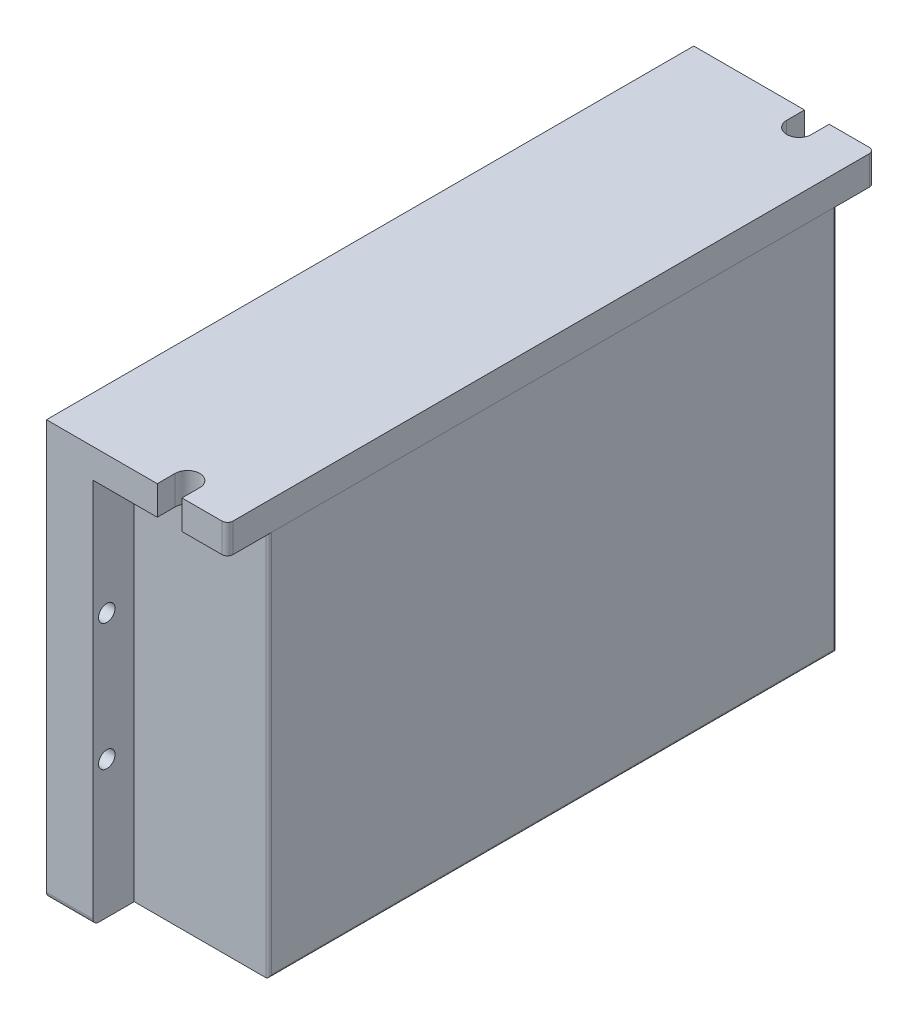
ISO-10303-21;
HEADER;
FILE_DESCRIPTION(('STEP AP214'),'2;1');
FILE_NAME('part.step','',(''),(''),'','','');
FILE_SCHEMA(('AUTOMOTIVE_DESIGN { 1 0 10303 214 1 1 1 1 }'));
ENDSEC;
DATA;
#1=APPLICATION_CONTEXT('core data for automotive mechanical design processes');
#2=APPLICATION_PROTOCOL_DEFINITION('international standard','automotive_design',2000,#1);
#3=PRODUCT_CONTEXT('',#1,'mechanical');
#4=PRODUCT('Part','Part','',(#3));
#5=PRODUCT_RELATED_PRODUCT_CATEGORY('part','',(#4));
#6=PRODUCT_DEFINITION_FORMATION('','',#4);
#7=PRODUCT_DEFINITION_CONTEXT('part definition',#1,'design');
#8=PRODUCT_DEFINITION('design','',#6,#7);
#9=PRODUCT_DEFINITION_SHAPE('','',#8);
#10=(LENGTH_UNIT() NAMED_UNIT(*) SI_UNIT(.MILLI.,.METRE.));
#11=(NAMED_UNIT(*) PLANE_ANGLE_UNIT() SI_UNIT($,.RADIAN.));
#12=(NAMED_UNIT(*) SI_UNIT($,.STERADIAN.) SOLID_ANGLE_UNIT());
#13=UNCERTAINTY_MEASURE_WITH_UNIT(LENGTH_MEASURE(1.E-05),#10,'distance_accuracy_value','');
#14=(GEOMETRIC_REPRESENTATION_CONTEXT(3) GLOBAL_UNCERTAINTY_ASSIGNED_CONTEXT((#13)) GLOBAL_UNIT_ASSIGNED_CONTEXT((#10,
#11,#12)) REPRESENTATION_CONTEXT('',''));
#15=CARTESIAN_POINT('',(0.,0.,0.));
#16=DIRECTION('',(0.,0.,1.));
#17=DIRECTION('',(1.,0.,0.));
#18=AXIS2_PLACEMENT_3D('',#15,#16,#17);
#19=CARTESIAN_POINT('',(33.,32.5,51.5));
#20=DIRECTION('',(0.,-1.,0.));
#21=DIRECTION('',(0.,0.,-1.));
#22=AXIS2_PLACEMENT_3D('',#19,#20,#21);
#23=PLANE('',#22);
#24=DIRECTION('',(0.,0.,1.));
#25=VECTOR('',#24,1.);
#26=CARTESIAN_POINT('',(33.,32.5,51.5));
#27=LINE('',#26,#25);
#28=CARTESIAN_POINT('',(33.,32.5,-51.5));
#29=VERTEX_POINT('',#28);
#30=CARTESIAN_POINT('',(33.,32.5,51.));
#31=VERTEX_POINT('',#30);
#32=EDGE_CURVE('E125',#29,#31,#27,.T.);
#33=ORIENTED_EDGE('',*,*,#32,.F.);
#34=CARTESIAN_POINT('',(32.5,32.5,-51.5));
#35=DIRECTION('',(0.,-1.,0.));
#36=DIRECTION('',(0.,0.,-1.));
#37=AXIS2_PLACEMENT_3D('',#34,#35,#36);
#38=CIRCLE('',#37,0.5);
#39=CARTESIAN_POINT('',(32.5,32.5,-52.));
#40=VERTEX_POINT('',#39);
#41=EDGE_CURVE('E142',#29,#40,#38,.F.);
#42=ORIENTED_EDGE('',*,*,#41,.T.);
#43=DIRECTION('',(-1.,0.,0.));
#44=VECTOR('',#43,1.);
#45=CARTESIAN_POINT('',(33.,32.5,-52.));
#46=LINE('',#45,#44);
#47=CARTESIAN_POINT('',(8.5,32.5,-52.));
#48=VERTEX_POINT('',#47);
#49=EDGE_CURVE('E119',#40,#48,#46,.T.);
#50=ORIENTED_EDGE('',*,*,#49,.T.);
#51=DIRECTION('',(0.,0.,1.));
#52=VECTOR('',#51,1.);
#53=CARTESIAN_POINT('',(8.5,32.5,51.5));
#54=LINE('',#53,#52);
#55=CARTESIAN_POINT('',(8.5,32.5,51.5));
#56=VERTEX_POINT('',#55);
#57=EDGE_CURVE('E114',#48,#56,#54,.T.);
#58=ORIENTED_EDGE('',*,*,#57,.T.);
#59=DIRECTION('',(-1.,0.,0.));
#60=VECTOR('',#59,1.);
#61=CARTESIAN_POINT('',(33.,32.5,51.5));
#62=LINE('',#61,#60);
#63=CARTESIAN_POINT('',(32.5,32.5,51.5));
#64=VERTEX_POINT('',#63);
#65=EDGE_CURVE('E98',#64,#56,#62,.T.);
#66=ORIENTED_EDGE('',*,*,#65,.F.);
#67=CARTESIAN_POINT('',(32.5,32.5,51.));
#68=DIRECTION('',(0.,-1.,0.));
#69=DIRECTION('',(0.,0.,-1.));
#70=AXIS2_PLACEMENT_3D('',#67,#68,#69);
#71=CIRCLE('',#70,0.5);
#72=EDGE_CURVE('E140',#64,#31,#71,.F.);
#73=ORIENTED_EDGE('',*,*,#72,.T.);
#74=EDGE_LOOP('',(#33,#42,#50,#58,#66,#73));
#75=FACE_BOUND('',#74,.T.);
#76=ADVANCED_FACE('F44',(#75),#23,.F.);
#77=CARTESIAN_POINT('',(33.,32.5,51.5));
#78=DIRECTION('',(0.,0.,-1.));
#79=DIRECTION('',(-1.,0.,0.));
#80=AXIS2_PLACEMENT_3D('',#77,#78,#79);
#81=PLANE('',#80);
#82=DIRECTION('',(-1.,0.,0.));
#83=VECTOR('',#82,1.);
#84=CARTESIAN_POINT('',(33.,-37.8,51.5));
#85=LINE('',#84,#83);
#86=CARTESIAN_POINT('',(32.5,-37.8,51.5));
#87=VERTEX_POINT('',#86);
#88=CARTESIAN_POINT('',(8.5,-37.8,51.5));
#89=VERTEX_POINT('',#88);
#90=EDGE_CURVE('E108',#87,#89,#85,.T.);
#91=ORIENTED_EDGE('',*,*,#90,.F.);
#92=DIRECTION('',(0.,-1.,0.));
#93=VECTOR('',#92,1.);
#94=CARTESIAN_POINT('',(32.5,32.5,51.5));
#95=LINE('',#94,#93);
#96=EDGE_CURVE('E53',#87,#64,#95,.F.);
#97=ORIENTED_EDGE('',*,*,#96,.T.);
#98=ORIENTED_EDGE('',*,*,#65,.T.);
#99=DIRECTION('',(0.,-1.,0.));
#100=VECTOR('',#99,1.);
#101=CARTESIAN_POINT('',(8.5,32.5,51.5));
#102=LINE('',#101,#100);
#103=EDGE_CURVE('E101',#56,#89,#102,.T.);
#104=ORIENTED_EDGE('',*,*,#103,.T.);
#105=EDGE_LOOP('',(#91,#97,#98,#104));
#106=FACE_BOUND('',#105,.T.);
#107=ADVANCED_FACE('F100',(#106),#81,.F.);
#108=CARTESIAN_POINT('',(33.,-37.8,51.5));
#109=DIRECTION('',(0.,1.,0.));
#110=DIRECTION('',(0.,0.,1.));
#111=AXIS2_PLACEMENT_3D('',#108,#109,#110);
#112=PLANE('',#111);
#113=DIRECTION('',(-1.,0.,0.));
#114=VECTOR('',#113,1.);
#115=CARTESIAN_POINT('',(33.,-37.8,-52.));
#116=LINE('',#115,#114);
#117=CARTESIAN_POINT('',(32.5,-37.8,-52.));
#118=VERTEX_POINT('',#117);
#119=CARTESIAN_POINT('',(8.5,-37.8,-52.));
#120=VERTEX_POINT('',#119);
#121=EDGE_CURVE('E131',#118,#120,#116,.T.);
#122=ORIENTED_EDGE('',*,*,#121,.F.);
#123=DIRECTION('',(0.,0.,-1.));
#124=VECTOR('',#123,1.);
#125=CARTESIAN_POINT('',(32.5,-37.8,51.5));
#126=LINE('',#125,#124);
#127=EDGE_CURVE('E12',#118,#87,#126,.F.);
#128=ORIENTED_EDGE('',*,*,#127,.T.);
#129=ORIENTED_EDGE('',*,*,#90,.T.);
#130=DIRECTION('',(0.,0.,-1.));
#131=VECTOR('',#130,1.);
#132=CARTESIAN_POINT('',(8.5,-37.8,51.5));
#133=LINE('',#132,#131);
#134=EDGE_CURVE('E116',#89,#120,#133,.T.);
#135=ORIENTED_EDGE('',*,*,#134,.T.);
#136=EDGE_LOOP('',(#122,#128,#129,#135));
#137=FACE_BOUND('',#136,.T.);
#138=ADVANCED_FACE('F167',(#137),#112,.F.);
#139=CARTESIAN_POINT('',(33.,-37.8,-52.));
#140=DIRECTION('',(0.,0.,1.));
#141=DIRECTION('',(0.,-1.,0.));
#142=AXIS2_PLACEMENT_3D('',#139,#140,#141);
#143=PLANE('',#142);
#144=ORIENTED_EDGE('',*,*,#49,.F.);
#145=DIRECTION('',(0.,1.,0.));
#146=VECTOR('',#145,1.);
#147=CARTESIAN_POINT('',(32.5,-37.8,-52.));
#148=LINE('',#147,#146);
#149=EDGE_CURVE('E67',#40,#118,#148,.F.);
#150=ORIENTED_EDGE('',*,*,#149,.T.);
#151=ORIENTED_EDGE('',*,*,#121,.T.);
#152=DIRECTION('',(0.,1.,0.));
#153=VECTOR('',#152,1.);
#154=CARTESIAN_POINT('',(8.5,-37.8,-52.));
#155=LINE('',#154,#153);
#156=EDGE_CURVE('E128',#120,#48,#155,.T.);
#157=ORIENTED_EDGE('',*,*,#156,.T.);
#158=EDGE_LOOP('',(#144,#150,#151,#157));
#159=FACE_BOUND('',#158,.T.);
#160=ADVANCED_FACE('F160',(#159),#143,.F.);
#161=CARTESIAN_POINT('',(33.,0.,0.));
#162=DIRECTION('',(1.,0.,0.));
#163=DIRECTION('',(0.,0.,-1.));
#164=AXIS2_PLACEMENT_3D('',#161,#162,#163);
#165=PLANE('',#164);
#166=DIRECTION('',(0.,0.,-1.));
#167=VECTOR('',#166,1.);
#168=CARTESIAN_POINT('',(33.,-37.3,-52.));
#169=LINE('',#168,#167);
#170=CARTESIAN_POINT('',(33.,-37.3,51.));
#171=VERTEX_POINT('',#170);
#172=CARTESIAN_POINT('',(33.,-37.3,-51.5));
#173=VERTEX_POINT('',#172);
#174=EDGE_CURVE('E107',#171,#173,#169,.T.);
#175=ORIENTED_EDGE('',*,*,#174,.T.);
#176=DIRECTION('',(0.,1.,0.));
#177=VECTOR('',#176,1.);
#178=CARTESIAN_POINT('',(33.,32.5,-51.5));
#179=LINE('',#178,#177);
#180=EDGE_CURVE('E137',#173,#29,#179,.T.);
#181=ORIENTED_EDGE('',*,*,#180,.T.);
#182=ORIENTED_EDGE('',*,*,#32,.T.);
#183=DIRECTION('',(0.,-1.,0.));
#184=VECTOR('',#183,1.);
#185=CARTESIAN_POINT('',(33.,-37.8,51.));
#186=LINE('',#185,#184);
#187=EDGE_CURVE('E135',#31,#171,#186,.T.);
#188=ORIENTED_EDGE('',*,*,#187,.T.);
#189=EDGE_LOOP('',(#175,#181,#182,#188));
#190=FACE_BOUND('',#189,.T.);
#191=ADVANCED_FACE('F158',(#190),#165,.T.);
#192=CARTESIAN_POINT('',(8.5,0.,0.));
#193=DIRECTION('',(1.,0.,0.));
#194=DIRECTION('',(0.,0.,-1.));
#195=AXIS2_PLACEMENT_3D('',#192,#193,#194);
#196=PLANE('',#195);
#197=ORIENTED_EDGE('',*,*,#57,.F.);
#198=ORIENTED_EDGE('',*,*,#156,.F.);
#199=ORIENTED_EDGE('',*,*,#134,.F.);
#200=ORIENTED_EDGE('',*,*,#103,.F.);
#201=EDGE_LOOP('',(#197,#198,#199,#200));
#202=FACE_BOUND('',#201,.T.);
#203=ADVANCED_FACE('F112',(#202),#196,.F.);
#204=CARTESIAN_POINT('',(32.5,0.,51.));
#205=DIRECTION('',(0.,1.,0.));
#206=DIRECTION('',(0.,0.,1.));
#207=AXIS2_PLACEMENT_3D('',#204,#205,#206);
#208=CYLINDRICAL_SURFACE('',#207,0.5);
#209=ORIENTED_EDGE('',*,*,#72,.F.);
#210=ORIENTED_EDGE('',*,*,#96,.F.);
#211=CARTESIAN_POINT('',(32.5,-37.3,51.));
#212=DIRECTION('',(0.,0.707106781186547,0.707106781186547));
#213=DIRECTION('',(0.,-0.707106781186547,0.707106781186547));
#214=AXIS2_PLACEMENT_3D('',#211,#212,#213);
#215=ELLIPSE('',#214,0.707106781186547,0.5);
#216=EDGE_CURVE('E48',#171,#87,#215,.F.);
#217=ORIENTED_EDGE('',*,*,#216,.F.);
#218=ORIENTED_EDGE('',*,*,#187,.F.);
#219=EDGE_LOOP('',(#209,#210,#217,#218));
#220=FACE_BOUND('',#219,.T.);
#221=ADVANCED_FACE('F46',(#220),#208,.T.);
#222=CARTESIAN_POINT('',(32.5,-37.3,0.));
#223=DIRECTION('',(0.,0.,1.));
#224=DIRECTION('',(1.,0.,0.));
#225=AXIS2_PLACEMENT_3D('',#222,#223,#224);
#226=CYLINDRICAL_SURFACE('',#225,0.5);
#227=ORIENTED_EDGE('',*,*,#216,.T.);
#228=ORIENTED_EDGE('',*,*,#127,.F.);
#229=CARTESIAN_POINT('',(32.5,-37.3,-51.5));
#230=DIRECTION('',(0.,-0.707106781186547,0.707106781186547));
#231=DIRECTION('',(0.,0.707106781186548,0.707106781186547));
#232=AXIS2_PLACEMENT_3D('',#229,#230,#231);
#233=ELLIPSE('',#232,0.707106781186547,0.5);
#234=EDGE_CURVE('E123',#173,#118,#233,.F.);
#235=ORIENTED_EDGE('',*,*,#234,.F.);
#236=ORIENTED_EDGE('',*,*,#174,.F.);
#237=EDGE_LOOP('',(#227,#228,#235,#236));
#238=FACE_BOUND('',#237,.T.);
#239=ADVANCED_FACE('F152',(#238),#226,.T.);
#240=CARTESIAN_POINT('',(32.5,0.,-51.5));
#241=DIRECTION('',(0.,-1.,0.));
#242=DIRECTION('',(0.,0.,-1.));
#243=AXIS2_PLACEMENT_3D('',#240,#241,#242);
#244=CYLINDRICAL_SURFACE('',#243,0.5);
#245=ORIENTED_EDGE('',*,*,#234,.T.);
#246=ORIENTED_EDGE('',*,*,#149,.F.);
#247=ORIENTED_EDGE('',*,*,#41,.F.);
#248=ORIENTED_EDGE('',*,*,#180,.F.);
#249=EDGE_LOOP('',(#245,#246,#247,#248));
#250=FACE_BOUND('',#249,.T.);
#251=ADVANCED_FACE('F149',(#250),#244,.T.);
#252=CLOSED_SHELL('',(#76,#107,#138,#160,#191,#203,#221,#239,#251));
#253=MANIFOLD_SOLID_BREP('B2',#252);
#254=CARTESIAN_POINT('',(8.5,-37.8,59.));
#255=DIRECTION('',(0.,0.,-1.));
#256=DIRECTION('',(-1.,0.,0.));
#257=AXIS2_PLACEMENT_3D('',#254,#255,#256);
#258=PLANE('',#257);
#259=DIRECTION('',(-1.,0.,0.));
#260=VECTOR('',#259,1.);
#261=CARTESIAN_POINT('',(33.,32.5,59.));
#262=LINE('',#261,#260);
#263=CARTESIAN_POINT('',(32.,32.5,59.));
#264=VERTEX_POINT('',#263);
#265=CARTESIAN_POINT('',(24.7,32.5,59.));
#266=VERTEX_POINT('',#265);
#267=EDGE_CURVE('E461',#264,#266,#262,.T.);
#268=ORIENTED_EDGE('',*,*,#267,.F.);
#269=DIRECTION('',(0.,-1.,0.));
#270=VECTOR('',#269,1.);
#271=CARTESIAN_POINT('',(32.,37.8,59.));
#272=LINE('',#271,#270);
#273=CARTESIAN_POINT('',(32.,37.8,59.));
#274=VERTEX_POINT('',#273);
#275=EDGE_CURVE('E484',#264,#274,#272,.F.);
#276=ORIENTED_EDGE('',*,*,#275,.T.);
#277=DIRECTION('',(-1.,0.,0.));
#278=VECTOR('',#277,1.);
#279=CARTESIAN_POINT('',(8.5,37.8,59.));
#280=LINE('',#279,#278);
#281=CARTESIAN_POINT('',(24.7,37.8,59.));
#282=VERTEX_POINT('',#281);
#283=EDGE_CURVE('E528',#274,#282,#280,.T.);
#284=ORIENTED_EDGE('',*,*,#283,.T.);
#285=DIRECTION('',(0.,1.,0.));
#286=VECTOR('',#285,1.);
#287=CARTESIAN_POINT('',(24.7,32.5,59.));
#288=LINE('',#287,#286);
#289=EDGE_CURVE('E400',#266,#282,#288,.T.);
#290=ORIENTED_EDGE('',*,*,#289,.F.);
#291=EDGE_LOOP('',(#268,#276,#284,#290));
#292=FACE_BOUND('',#291,.T.);
#293=ADVANCED_FACE('F233',(#292),#258,.F.);
#294=CARTESIAN_POINT('',(8.5,-37.8,-59.));
#295=DIRECTION('',(0.,0.,1.));
#296=DIRECTION('',(1.,0.,0.));
#297=AXIS2_PLACEMENT_3D('',#294,#295,#296);
#298=PLANE('',#297);
#299=DIRECTION('',(0.,1.,0.));
#300=VECTOR('',#299,1.);
#301=CARTESIAN_POINT('',(8.5,-37.8,-59.));
#302=LINE('',#301,#300);
#303=CARTESIAN_POINT('',(8.5,-36.8,-59.));
#304=VERTEX_POINT('',#303);
#305=CARTESIAN_POINT('',(8.5,32.5,-59.));
#306=VERTEX_POINT('',#305);
#307=EDGE_CURVE('E496',#304,#306,#302,.T.);
#308=ORIENTED_EDGE('',*,*,#307,.F.);
#309=DIRECTION('',(-1.,0.,0.));
#310=VECTOR('',#309,1.);
#311=CARTESIAN_POINT('',(8.5,-36.8,-59.));
#312=LINE('',#311,#310);
#313=CARTESIAN_POINT('',(0.,-36.8,-59.));
#314=VERTEX_POINT('',#313);
#315=EDGE_CURVE('E42',#304,#314,#312,.T.);
#316=ORIENTED_EDGE('',*,*,#315,.T.);
#317=DIRECTION('',(0.,1.,0.));
#318=VECTOR('',#317,1.);
#319=CARTESIAN_POINT('',(0.,-37.8,-59.));
#320=LINE('',#319,#318);
#321=CARTESIAN_POINT('',(0.,37.8,-59.));
#322=VERTEX_POINT('',#321);
#323=EDGE_CURVE('E481',#314,#322,#320,.T.);
#324=ORIENTED_EDGE('',*,*,#323,.T.);
#325=DIRECTION('',(-1.,0.,0.));
#326=VECTOR('',#325,1.);
#327=CARTESIAN_POINT('',(8.5,37.8,-59.));
#328=LINE('',#327,#326);
#329=CARTESIAN_POINT('',(20.2,37.8,-59.));
#330=VERTEX_POINT('',#329);
#331=EDGE_CURVE('E529',#330,#322,#328,.T.);
#332=ORIENTED_EDGE('',*,*,#331,.F.);
#333=DIRECTION('',(0.,1.,0.));
#334=VECTOR('',#333,1.);
#335=CARTESIAN_POINT('',(20.2,32.5,-59.));
#336=LINE('',#335,#334);
#337=CARTESIAN_POINT('',(20.2,32.5,-59.));
#338=VERTEX_POINT('',#337);
#339=EDGE_CURVE('E425',#338,#330,#336,.T.);
#340=ORIENTED_EDGE('',*,*,#339,.F.);
#341=DIRECTION('',(-1.,0.,0.));
#342=VECTOR('',#341,1.);
#343=CARTESIAN_POINT('',(33.,32.5,-59.));
#344=LINE('',#343,#342);
#345=EDGE_CURVE('E437',#338,#306,#344,.T.);
#346=ORIENTED_EDGE('',*,*,#345,.T.);
#347=EDGE_LOOP('',(#308,#316,#324,#332,#340,#346));
#348=FACE_BOUND('',#347,.T.);
#349=ADVANCED_FACE('F540',(#348),#298,.F.);
#350=CARTESIAN_POINT('',(8.5,0.,0.));
#351=DIRECTION('',(-1.,0.,0.));
#352=DIRECTION('',(0.,0.,1.));
#353=AXIS2_PLACEMENT_3D('',#350,#351,#352);
#354=PLANE('',#353);
#355=CARTESIAN_POINT('',(8.5,10.3,-56.5));
#356=DIRECTION('',(1.,0.,0.));
#357=DIRECTION('',(0.,0.,-1.));
#358=AXIS2_PLACEMENT_3D('',#355,#356,#357);
#359=CIRCLE('',#358,1.5);
#360=CARTESIAN_POINT('',(8.5,10.3,-58.));
#361=VERTEX_POINT('',#360);
#362=EDGE_CURVE('E655',#361,#361,#359,.T.);
#363=ORIENTED_EDGE('',*,*,#362,.F.);
#364=EDGE_LOOP('',(#363));
#365=FACE_BOUND('',#364,.T.);
#366=CARTESIAN_POINT('',(8.5,10.3,56.5));
#367=DIRECTION('',(1.,0.,0.));
#368=DIRECTION('',(0.,0.,-1.));
#369=AXIS2_PLACEMENT_3D('',#366,#367,#368);
#370=CIRCLE('',#369,1.5);
#371=CARTESIAN_POINT('',(8.5,10.3,55.));
#372=VERTEX_POINT('',#371);
#373=EDGE_CURVE('E651',#372,#372,#370,.T.);
#374=ORIENTED_EDGE('',*,*,#373,.F.);
#375=EDGE_LOOP('',(#374));
#376=FACE_BOUND('',#375,.T.);
#377=CARTESIAN_POINT('',(8.5,-12.8,-56.5));
#378=DIRECTION('',(1.,0.,0.));
#379=DIRECTION('',(0.,0.,-1.));
#380=AXIS2_PLACEMENT_3D('',#377,#378,#379);
#381=CIRCLE('',#380,1.5);
#382=CARTESIAN_POINT('',(8.5,-12.8,-58.));
#383=VERTEX_POINT('',#382);
#384=EDGE_CURVE('E647',#383,#383,#381,.T.);
#385=ORIENTED_EDGE('',*,*,#384,.F.);
#386=EDGE_LOOP('',(#385));
#387=FACE_BOUND('',#386,.T.);
#388=CARTESIAN_POINT('',(8.5,-12.8,56.5));
#389=DIRECTION('',(1.,0.,0.));
#390=DIRECTION('',(0.,0.,-1.));
#391=AXIS2_PLACEMENT_3D('',#388,#389,#390);
#392=CIRCLE('',#391,1.5);
#393=CARTESIAN_POINT('',(8.5,-12.8,55.));
#394=VERTEX_POINT('',#393);
#395=EDGE_CURVE('E390',#394,#394,#392,.T.);
#396=ORIENTED_EDGE('',*,*,#395,.F.);
#397=EDGE_LOOP('',(#396));
#398=FACE_BOUND('',#397,.T.);
#399=DIRECTION('',(0.,-1.,0.));
#400=VECTOR('',#399,1.);
#401=CARTESIAN_POINT('',(8.5,-37.8,59.));
#402=LINE('',#401,#400);
#403=CARTESIAN_POINT('',(8.5,32.5,59.));
#404=VERTEX_POINT('',#403);
#405=CARTESIAN_POINT('',(8.5,-36.8,59.));
#406=VERTEX_POINT('',#405);
#407=EDGE_CURVE('E446',#404,#406,#402,.T.);
#408=ORIENTED_EDGE('',*,*,#407,.T.);
#409=CARTESIAN_POINT('',(8.5,-36.8,58.));
#410=DIRECTION('',(-1.,0.,0.));
#411=DIRECTION('',(0.,0.,1.));
#412=AXIS2_PLACEMENT_3D('',#409,#410,#411);
#413=CIRCLE('',#412,1.);
#414=CARTESIAN_POINT('',(8.5,-37.8,58.));
#415=VERTEX_POINT('',#414);
#416=EDGE_CURVE('E241',#406,#415,#413,.F.);
#417=ORIENTED_EDGE('',*,*,#416,.T.);
#418=DIRECTION('',(0.,0.,-1.));
#419=VECTOR('',#418,1.);
#420=CARTESIAN_POINT('',(8.5,-37.8,59.));
#421=LINE('',#420,#419);
#422=CARTESIAN_POINT('',(8.5,-37.8,-58.));
#423=VERTEX_POINT('',#422);
#424=EDGE_CURVE('E502',#415,#423,#421,.T.);
#425=ORIENTED_EDGE('',*,*,#424,.T.);
#426=CARTESIAN_POINT('',(8.5,-36.8,-58.));
#427=DIRECTION('',(-1.,0.,0.));
#428=DIRECTION('',(0.,0.,1.));
#429=AXIS2_PLACEMENT_3D('',#426,#427,#428);
#430=CIRCLE('',#429,1.);
#431=EDGE_CURVE('E248',#423,#304,#430,.F.);
#432=ORIENTED_EDGE('',*,*,#431,.T.);
#433=ORIENTED_EDGE('',*,*,#307,.T.);
#434=DIRECTION('',(0.,0.,-1.));
#435=VECTOR('',#434,1.);
#436=CARTESIAN_POINT('',(8.5,32.5,59.));
#437=LINE('',#436,#435);
#438=EDGE_CURVE('E424',#404,#306,#437,.T.);
#439=ORIENTED_EDGE('',*,*,#438,.F.);
#440=EDGE_LOOP('',(#408,#417,#425,#432,#433,#439));
#441=FACE_BOUND('',#440,.T.);
#442=ADVANCED_FACE('F501',(#365,#376,#387,#398,#441),#354,.F.);
#443=CARTESIAN_POINT('',(32.,37.8,-59.));
#444=VERTEX_POINT('',#443);
#445=CARTESIAN_POINT('',(24.7,37.8,-59.));
#446=VERTEX_POINT('',#445);
#447=EDGE_CURVE('E466',#444,#446,#328,.T.);
#448=ORIENTED_EDGE('',*,*,#447,.F.);
#449=DIRECTION('',(0.,1.,0.));
#450=VECTOR('',#449,1.);
#451=CARTESIAN_POINT('',(32.,32.5,-59.));
#452=LINE('',#451,#450);
#453=CARTESIAN_POINT('',(32.,32.5,-59.));
#454=VERTEX_POINT('',#453);
#455=EDGE_CURVE('E471',#444,#454,#452,.F.);
#456=ORIENTED_EDGE('',*,*,#455,.T.);
#457=CARTESIAN_POINT('',(24.7,32.5,-59.));
#458=VERTEX_POINT('',#457);
#459=EDGE_CURVE('E454',#454,#458,#344,.T.);
#460=ORIENTED_EDGE('',*,*,#459,.T.);
#461=DIRECTION('',(0.,1.,0.));
#462=VECTOR('',#461,1.);
#463=CARTESIAN_POINT('',(24.7,32.5,-59.));
#464=LINE('',#463,#462);
#465=EDGE_CURVE('E427',#458,#446,#464,.T.);
#466=ORIENTED_EDGE('',*,*,#465,.T.);
#467=EDGE_LOOP('',(#448,#456,#460,#466));
#468=FACE_BOUND('',#467,.T.);
#469=ADVANCED_FACE('F560',(#468),#298,.F.);
#470=CARTESIAN_POINT('',(8.5,37.8,59.));
#471=DIRECTION('',(0.,-1.,0.));
#472=DIRECTION('',(0.,0.,-1.));
#473=AXIS2_PLACEMENT_3D('',#470,#471,#472);
#474=PLANE('',#473);
#475=DIRECTION('',(0.,0.,1.));
#476=VECTOR('',#475,1.);
#477=CARTESIAN_POINT('',(33.,37.8,-59.));
#478=LINE('',#477,#476);
#479=CARTESIAN_POINT('',(33.,37.8,-58.));
#480=VERTEX_POINT('',#479);
#481=CARTESIAN_POINT('',(33.,37.8,58.));
#482=VERTEX_POINT('',#481);
#483=EDGE_CURVE('E431',#480,#482,#478,.T.);
#484=ORIENTED_EDGE('',*,*,#483,.F.);
#485=CARTESIAN_POINT('',(32.,37.8,-58.));
#486=DIRECTION('',(0.,-1.,0.));
#487=DIRECTION('',(0.,0.,-1.));
#488=AXIS2_PLACEMENT_3D('',#485,#486,#487);
#489=CIRCLE('',#488,1.);
#490=EDGE_CURVE('E470',#480,#444,#489,.F.);
#491=ORIENTED_EDGE('',*,*,#490,.T.);
#492=ORIENTED_EDGE('',*,*,#447,.T.);
#493=DIRECTION('',(0.,0.,-1.));
#494=VECTOR('',#493,1.);
#495=CARTESIAN_POINT('',(24.7,37.8,-59.));
#496=LINE('',#495,#494);
#497=CARTESIAN_POINT('',(24.7,37.8,-55.75));
#498=VERTEX_POINT('',#497);
#499=EDGE_CURVE('E417',#498,#446,#496,.T.);
#500=ORIENTED_EDGE('',*,*,#499,.F.);
#501=CARTESIAN_POINT('',(22.45,37.8,-55.75));
#502=DIRECTION('',(0.,1.,0.));
#503=DIRECTION('',(0.,0.,1.));
#504=AXIS2_PLACEMENT_3D('',#501,#502,#503);
#505=CIRCLE('',#504,2.25);
#506=CARTESIAN_POINT('',(20.2,37.8,-55.75));
#507=VERTEX_POINT('',#506);
#508=EDGE_CURVE('E399',#507,#498,#505,.T.);
#509=ORIENTED_EDGE('',*,*,#508,.F.);
#510=DIRECTION('',(0.,0.,1.));
#511=VECTOR('',#510,1.);
#512=CARTESIAN_POINT('',(20.2,37.8,-55.75));
#513=LINE('',#512,#511);
#514=EDGE_CURVE('E408',#330,#507,#513,.T.);
#515=ORIENTED_EDGE('',*,*,#514,.F.);
#516=ORIENTED_EDGE('',*,*,#331,.T.);
#517=DIRECTION('',(0.,0.,1.));
#518=VECTOR('',#517,1.);
#519=CARTESIAN_POINT('',(0.,37.8,59.));
#520=LINE('',#519,#518);
#521=CARTESIAN_POINT('',(0.,37.8,59.));
#522=VERTEX_POINT('',#521);
#523=EDGE_CURVE('E522',#322,#522,#520,.T.);
#524=ORIENTED_EDGE('',*,*,#523,.T.);
#525=CARTESIAN_POINT('',(20.2,37.8,59.));
#526=VERTEX_POINT('',#525);
#527=EDGE_CURVE('E511',#526,#522,#280,.T.);
#528=ORIENTED_EDGE('',*,*,#527,.F.);
#529=DIRECTION('',(0.,0.,1.));
#530=VECTOR('',#529,1.);
#531=CARTESIAN_POINT('',(20.2,37.8,55.75));
#532=LINE('',#531,#530);
#533=CARTESIAN_POINT('',(20.2,37.8,55.75));
#534=VERTEX_POINT('',#533);
#535=EDGE_CURVE('E387',#534,#526,#532,.T.);
#536=ORIENTED_EDGE('',*,*,#535,.F.);
#537=CARTESIAN_POINT('',(22.45,37.8,55.75));
#538=DIRECTION('',(0.,1.,0.));
#539=DIRECTION('',(0.,0.,1.));
#540=AXIS2_PLACEMENT_3D('',#537,#538,#539);
#541=CIRCLE('',#540,2.25);
#542=CARTESIAN_POINT('',(24.7,37.8,55.75));
#543=VERTEX_POINT('',#542);
#544=EDGE_CURVE('E368',#543,#534,#541,.T.);
#545=ORIENTED_EDGE('',*,*,#544,.F.);
#546=DIRECTION('',(0.,0.,-1.));
#547=VECTOR('',#546,1.);
#548=CARTESIAN_POINT('',(24.7,37.8,59.));
#549=LINE('',#548,#547);
#550=EDGE_CURVE('E384',#282,#543,#549,.T.);
#551=ORIENTED_EDGE('',*,*,#550,.F.);
#552=ORIENTED_EDGE('',*,*,#283,.F.);
#553=CARTESIAN_POINT('',(32.,37.8,58.));
#554=DIRECTION('',(0.,-1.,0.));
#555=DIRECTION('',(0.,0.,-1.));
#556=AXIS2_PLACEMENT_3D('',#553,#554,#555);
#557=CIRCLE('',#556,1.);
#558=EDGE_CURVE('E469',#274,#482,#557,.F.);
#559=ORIENTED_EDGE('',*,*,#558,.T.);
#560=EDGE_LOOP('',(#484,#491,#492,#500,#509,#515,#516,#524,#528,#536,#545,#551,#552,#559));
#561=FACE_BOUND('',#560,.T.);
#562=ADVANCED_FACE('F534',(#561),#474,.F.);
#563=DIRECTION('',(0.,-1.,0.));
#564=VECTOR('',#563,1.);
#565=CARTESIAN_POINT('',(0.,-37.8,59.));
#566=LINE('',#565,#564);
#567=CARTESIAN_POINT('',(0.,-36.8,59.));
#568=VERTEX_POINT('',#567);
#569=EDGE_CURVE('E518',#522,#568,#566,.T.);
#570=ORIENTED_EDGE('',*,*,#569,.T.);
#571=DIRECTION('',(-1.,0.,0.));
#572=VECTOR('',#571,1.);
#573=CARTESIAN_POINT('',(8.5,-36.8,59.));
#574=LINE('',#573,#572);
#575=EDGE_CURVE('E256',#568,#406,#574,.F.);
#576=ORIENTED_EDGE('',*,*,#575,.T.);
#577=ORIENTED_EDGE('',*,*,#407,.F.);
#578=CARTESIAN_POINT('',(20.2,32.5,59.));
#579=VERTEX_POINT('',#578);
#580=EDGE_CURVE('E459',#579,#404,#262,.T.);
#581=ORIENTED_EDGE('',*,*,#580,.F.);
#582=DIRECTION('',(0.,1.,0.));
#583=VECTOR('',#582,1.);
#584=CARTESIAN_POINT('',(20.2,32.5,59.));
#585=LINE('',#584,#583);
#586=EDGE_CURVE('E371',#579,#526,#585,.T.);
#587=ORIENTED_EDGE('',*,*,#586,.T.);
#588=ORIENTED_EDGE('',*,*,#527,.T.);
#589=EDGE_LOOP('',(#570,#576,#577,#581,#587,#588));
#590=FACE_BOUND('',#589,.T.);
#591=ADVANCED_FACE('F519',(#590),#258,.F.);
#592=CARTESIAN_POINT('',(8.5,-37.8,59.));
#593=DIRECTION('',(0.,1.,0.));
#594=DIRECTION('',(0.,0.,1.));
#595=AXIS2_PLACEMENT_3D('',#592,#593,#594);
#596=PLANE('',#595);
#597=ORIENTED_EDGE('',*,*,#424,.F.);
#598=DIRECTION('',(-1.,0.,0.));
#599=VECTOR('',#598,1.);
#600=CARTESIAN_POINT('',(8.5,-37.8,58.));
#601=LINE('',#600,#599);
#602=CARTESIAN_POINT('',(0.,-37.8,58.));
#603=VERTEX_POINT('',#602);
#604=EDGE_CURVE('E488',#415,#603,#601,.T.);
#605=ORIENTED_EDGE('',*,*,#604,.T.);
#606=DIRECTION('',(0.,0.,-1.));
#607=VECTOR('',#606,1.);
#608=CARTESIAN_POINT('',(0.,-37.8,59.));
#609=LINE('',#608,#607);
#610=CARTESIAN_POINT('',(0.,-37.8,-58.));
#611=VERTEX_POINT('',#610);
#612=EDGE_CURVE('E498',#603,#611,#609,.T.);
#613=ORIENTED_EDGE('',*,*,#612,.T.);
#614=DIRECTION('',(-1.,0.,0.));
#615=VECTOR('',#614,1.);
#616=CARTESIAN_POINT('',(8.5,-37.8,-58.));
#617=LINE('',#616,#615);
#618=EDGE_CURVE('E486',#611,#423,#617,.F.);
#619=ORIENTED_EDGE('',*,*,#618,.T.);
#620=EDGE_LOOP('',(#597,#605,#613,#619));
#621=FACE_BOUND('',#620,.T.);
#622=ADVANCED_FACE('F507',(#621),#596,.F.);
#623=CARTESIAN_POINT('',(0.,0.,0.));
#624=DIRECTION('',(-1.,0.,0.));
#625=DIRECTION('',(0.,0.,1.));
#626=AXIS2_PLACEMENT_3D('',#623,#624,#625);
#627=PLANE('',#626);
#628=CARTESIAN_POINT('',(0.,10.3,-56.5));
#629=DIRECTION('',(1.,0.,0.));
#630=DIRECTION('',(0.,0.,-1.));
#631=AXIS2_PLACEMENT_3D('',#628,#629,#630);
#632=CIRCLE('',#631,1.5);
#633=CARTESIAN_POINT('',(0.,10.3,-58.));
#634=VERTEX_POINT('',#633);
#635=EDGE_CURVE('E634',#634,#634,#632,.T.);
#636=ORIENTED_EDGE('',*,*,#635,.T.);
#637=EDGE_LOOP('',(#636));
#638=FACE_BOUND('',#637,.T.);
#639=CARTESIAN_POINT('',(0.,10.3,56.5));
#640=DIRECTION('',(1.,0.,0.));
#641=DIRECTION('',(0.,0.,-1.));
#642=AXIS2_PLACEMENT_3D('',#639,#640,#641);
#643=CIRCLE('',#642,1.5);
#644=CARTESIAN_POINT('',(0.,10.3,55.));
#645=VERTEX_POINT('',#644);
#646=EDGE_CURVE('E638',#645,#645,#643,.T.);
#647=ORIENTED_EDGE('',*,*,#646,.T.);
#648=EDGE_LOOP('',(#647));
#649=FACE_BOUND('',#648,.T.);
#650=CARTESIAN_POINT('',(0.,-12.8,-56.5));
#651=DIRECTION('',(1.,0.,0.));
#652=DIRECTION('',(0.,0.,-1.));
#653=AXIS2_PLACEMENT_3D('',#650,#651,#652);
#654=CIRCLE('',#653,1.5);
#655=CARTESIAN_POINT('',(0.,-12.8,-58.));
#656=VERTEX_POINT('',#655);
#657=EDGE_CURVE('E642',#656,#656,#654,.T.);
#658=ORIENTED_EDGE('',*,*,#657,.T.);
#659=EDGE_LOOP('',(#658));
#660=FACE_BOUND('',#659,.T.);
#661=CARTESIAN_POINT('',(0.,-12.8,56.5));
#662=DIRECTION('',(1.,0.,0.));
#663=DIRECTION('',(0.,0.,-1.));
#664=AXIS2_PLACEMENT_3D('',#661,#662,#663);
#665=CIRCLE('',#664,1.5);
#666=CARTESIAN_POINT('',(0.,-12.8,55.));
#667=VERTEX_POINT('',#666);
#668=EDGE_CURVE('E395',#667,#667,#665,.T.);
#669=ORIENTED_EDGE('',*,*,#668,.T.);
#670=EDGE_LOOP('',(#669));
#671=FACE_BOUND('',#670,.T.);
#672=ORIENTED_EDGE('',*,*,#612,.F.);
#673=CARTESIAN_POINT('',(0.,-36.8,58.));
#674=DIRECTION('',(-1.,0.,0.));
#675=DIRECTION('',(0.,0.,1.));
#676=AXIS2_PLACEMENT_3D('',#673,#674,#675);
#677=CIRCLE('',#676,1.);
#678=EDGE_CURVE('E493',#603,#568,#677,.T.);
#679=ORIENTED_EDGE('',*,*,#678,.T.);
#680=ORIENTED_EDGE('',*,*,#569,.F.);
#681=ORIENTED_EDGE('',*,*,#523,.F.);
#682=ORIENTED_EDGE('',*,*,#323,.F.);
#683=CARTESIAN_POINT('',(0.,-36.8,-58.));
#684=DIRECTION('',(-1.,0.,0.));
#685=DIRECTION('',(0.,0.,1.));
#686=AXIS2_PLACEMENT_3D('',#683,#684,#685);
#687=CIRCLE('',#686,1.);
#688=EDGE_CURVE('E491',#314,#611,#687,.T.);
#689=ORIENTED_EDGE('',*,*,#688,.T.);
#690=EDGE_LOOP('',(#672,#679,#680,#681,#682,#689));
#691=FACE_BOUND('',#690,.T.);
#692=ADVANCED_FACE('F516',(#638,#649,#660,#671,#691),#627,.T.);
#693=CARTESIAN_POINT('',(33.,32.5,59.));
#694=DIRECTION('',(0.,1.,0.));
#695=DIRECTION('',(0.,0.,1.));
#696=AXIS2_PLACEMENT_3D('',#693,#694,#695);
#697=PLANE('',#696);
#698=ORIENTED_EDGE('',*,*,#459,.F.);
#699=CARTESIAN_POINT('',(32.,32.5,-58.));
#700=DIRECTION('',(0.,1.,0.));
#701=DIRECTION('',(0.,0.,1.));
#702=AXIS2_PLACEMENT_3D('',#699,#700,#701);
#703=CIRCLE('',#702,1.);
#704=CARTESIAN_POINT('',(33.,32.5,-58.));
#705=VERTEX_POINT('',#704);
#706=EDGE_CURVE('E478',#454,#705,#703,.F.);
#707=ORIENTED_EDGE('',*,*,#706,.T.);
#708=DIRECTION('',(0.,0.,-1.));
#709=VECTOR('',#708,1.);
#710=CARTESIAN_POINT('',(33.,32.5,59.));
#711=LINE('',#710,#709);
#712=CARTESIAN_POINT('',(33.,32.5,58.));
#713=VERTEX_POINT('',#712);
#714=EDGE_CURVE('E434',#713,#705,#711,.T.);
#715=ORIENTED_EDGE('',*,*,#714,.F.);
#716=CARTESIAN_POINT('',(32.,32.5,58.));
#717=DIRECTION('',(0.,1.,0.));
#718=DIRECTION('',(0.,0.,1.));
#719=AXIS2_PLACEMENT_3D('',#716,#717,#718);
#720=CIRCLE('',#719,1.);
#721=EDGE_CURVE('E475',#713,#264,#720,.F.);
#722=ORIENTED_EDGE('',*,*,#721,.T.);
#723=ORIENTED_EDGE('',*,*,#267,.T.);
#724=DIRECTION('',(0.,0.,-1.));
#725=VECTOR('',#724,1.);
#726=CARTESIAN_POINT('',(24.7,32.5,59.));
#727=LINE('',#726,#725);
#728=CARTESIAN_POINT('',(24.7,32.5,55.75));
#729=VERTEX_POINT('',#728);
#730=EDGE_CURVE('E372',#266,#729,#727,.T.);
#731=ORIENTED_EDGE('',*,*,#730,.T.);
#732=CARTESIAN_POINT('',(22.45,32.5,55.75));
#733=DIRECTION('',(0.,1.,0.));
#734=DIRECTION('',(0.,0.,1.));
#735=AXIS2_PLACEMENT_3D('',#732,#733,#734);
#736=CIRCLE('',#735,2.25);
#737=CARTESIAN_POINT('',(20.2,32.5,55.75));
#738=VERTEX_POINT('',#737);
#739=EDGE_CURVE('E365',#729,#738,#736,.T.);
#740=ORIENTED_EDGE('',*,*,#739,.T.);
#741=DIRECTION('',(0.,0.,1.));
#742=VECTOR('',#741,1.);
#743=CARTESIAN_POINT('',(20.2,32.5,55.75));
#744=LINE('',#743,#742);
#745=EDGE_CURVE('E375',#738,#579,#744,.T.);
#746=ORIENTED_EDGE('',*,*,#745,.T.);
#747=ORIENTED_EDGE('',*,*,#580,.T.);
#748=ORIENTED_EDGE('',*,*,#438,.T.);
#749=ORIENTED_EDGE('',*,*,#345,.F.);
#750=DIRECTION('',(0.,0.,1.));
#751=VECTOR('',#750,1.);
#752=CARTESIAN_POINT('',(20.2,32.5,-55.75));
#753=LINE('',#752,#751);
#754=CARTESIAN_POINT('',(20.2,32.5,-55.75));
#755=VERTEX_POINT('',#754);
#756=EDGE_CURVE('E411',#338,#755,#753,.T.);
#757=ORIENTED_EDGE('',*,*,#756,.T.);
#758=CARTESIAN_POINT('',(22.45,32.5,-55.75));
#759=DIRECTION('',(0.,1.,0.));
#760=DIRECTION('',(0.,0.,1.));
#761=AXIS2_PLACEMENT_3D('',#758,#759,#760);
#762=CIRCLE('',#761,2.25);
#763=CARTESIAN_POINT('',(24.7,32.5,-55.75));
#764=VERTEX_POINT('',#763);
#765=EDGE_CURVE('E404',#755,#764,#762,.T.);
#766=ORIENTED_EDGE('',*,*,#765,.T.);
#767=DIRECTION('',(0.,0.,-1.));
#768=VECTOR('',#767,1.);
#769=CARTESIAN_POINT('',(24.7,32.5,-59.));
#770=LINE('',#769,#768);
#771=EDGE_CURVE('E407',#764,#458,#770,.T.);
#772=ORIENTED_EDGE('',*,*,#771,.T.);
#773=EDGE_LOOP('',(#698,#707,#715,#722,#723,#731,#740,#746,#747,#748,#749,#757,#766,#772));
#774=FACE_BOUND('',#773,.T.);
#775=ADVANCED_FACE('F382',(#774),#697,.F.);
#776=CARTESIAN_POINT('',(33.,0.,0.));
#777=DIRECTION('',(1.,0.,0.));
#778=DIRECTION('',(0.,0.,-1.));
#779=AXIS2_PLACEMENT_3D('',#776,#777,#778);
#780=PLANE('',#779);
#781=ORIENTED_EDGE('',*,*,#714,.T.);
#782=DIRECTION('',(0.,1.,0.));
#783=VECTOR('',#782,1.);
#784=CARTESIAN_POINT('',(33.,37.8,-58.));
#785=LINE('',#784,#783);
#786=EDGE_CURVE('E465',#705,#480,#785,.T.);
#787=ORIENTED_EDGE('',*,*,#786,.T.);
#788=ORIENTED_EDGE('',*,*,#483,.T.);
#789=DIRECTION('',(0.,-1.,0.));
#790=VECTOR('',#789,1.);
#791=CARTESIAN_POINT('',(33.,32.5,58.));
#792=LINE('',#791,#790);
#793=EDGE_CURVE('E462',#482,#713,#792,.T.);
#794=ORIENTED_EDGE('',*,*,#793,.T.);
#795=EDGE_LOOP('',(#781,#787,#788,#794));
#796=FACE_BOUND('',#795,.T.);
#797=ADVANCED_FACE('F587',(#796),#780,.T.);
#798=CARTESIAN_POINT('',(22.45,32.5,-55.75));
#799=DIRECTION('',(0.,1.,0.));
#800=DIRECTION('',(0.,0.,1.));
#801=AXIS2_PLACEMENT_3D('',#798,#799,#800);
#802=CYLINDRICAL_SURFACE('',#801,2.25);
#803=ORIENTED_EDGE('',*,*,#508,.T.);
#804=DIRECTION('',(0.,1.,0.));
#805=VECTOR('',#804,1.);
#806=CARTESIAN_POINT('',(24.7,32.5,-55.75));
#807=LINE('',#806,#805);
#808=EDGE_CURVE('E414',#764,#498,#807,.T.);
#809=ORIENTED_EDGE('',*,*,#808,.F.);
#810=ORIENTED_EDGE('',*,*,#765,.F.);
#811=DIRECTION('',(0.,1.,0.));
#812=VECTOR('',#811,1.);
#813=CARTESIAN_POINT('',(20.2,32.5,-55.75));
#814=LINE('',#813,#812);
#815=EDGE_CURVE('E422',#755,#507,#814,.T.);
#816=ORIENTED_EDGE('',*,*,#815,.T.);
#817=EDGE_LOOP('',(#803,#809,#810,#816));
#818=FACE_BOUND('',#817,.T.);
#819=ADVANCED_FACE('F596',(#818),#802,.F.);
#820=CARTESIAN_POINT('',(20.2,32.5,-55.75));
#821=DIRECTION('',(-1.,0.,0.));
#822=DIRECTION('',(0.,0.,1.));
#823=AXIS2_PLACEMENT_3D('',#820,#821,#822);
#824=PLANE('',#823);
#825=ORIENTED_EDGE('',*,*,#514,.T.);
#826=ORIENTED_EDGE('',*,*,#815,.F.);
#827=ORIENTED_EDGE('',*,*,#756,.F.);
#828=ORIENTED_EDGE('',*,*,#339,.T.);
#829=EDGE_LOOP('',(#825,#826,#827,#828));
#830=FACE_BOUND('',#829,.T.);
#831=ADVANCED_FACE('F599',(#830),#824,.F.);
#832=CARTESIAN_POINT('',(24.7,32.5,-59.));
#833=DIRECTION('',(1.,0.,0.));
#834=DIRECTION('',(0.,0.,-1.));
#835=AXIS2_PLACEMENT_3D('',#832,#833,#834);
#836=PLANE('',#835);
#837=ORIENTED_EDGE('',*,*,#499,.T.);
#838=ORIENTED_EDGE('',*,*,#465,.F.);
#839=ORIENTED_EDGE('',*,*,#771,.F.);
#840=ORIENTED_EDGE('',*,*,#808,.T.);
#841=EDGE_LOOP('',(#837,#838,#839,#840));
#842=FACE_BOUND('',#841,.T.);
#843=ADVANCED_FACE('F594',(#842),#836,.F.);
#844=CARTESIAN_POINT('',(22.45,32.5,55.75));
#845=DIRECTION('',(0.,1.,0.));
#846=DIRECTION('',(0.,0.,1.));
#847=AXIS2_PLACEMENT_3D('',#844,#845,#846);
#848=CYLINDRICAL_SURFACE('',#847,2.25);
#849=ORIENTED_EDGE('',*,*,#544,.T.);
#850=DIRECTION('',(0.,1.,0.));
#851=VECTOR('',#850,1.);
#852=CARTESIAN_POINT('',(20.2,32.5,55.75));
#853=LINE('',#852,#851);
#854=EDGE_CURVE('E361',#738,#534,#853,.T.);
#855=ORIENTED_EDGE('',*,*,#854,.F.);
#856=ORIENTED_EDGE('',*,*,#739,.F.);
#857=DIRECTION('',(0.,1.,0.));
#858=VECTOR('',#857,1.);
#859=CARTESIAN_POINT('',(24.7,32.5,55.75));
#860=LINE('',#859,#858);
#861=EDGE_CURVE('E397',#729,#543,#860,.T.);
#862=ORIENTED_EDGE('',*,*,#861,.T.);
#863=EDGE_LOOP('',(#849,#855,#856,#862));
#864=FACE_BOUND('',#863,.T.);
#865=ADVANCED_FACE('F363',(#864),#848,.F.);
#866=CARTESIAN_POINT('',(24.7,32.5,59.));
#867=DIRECTION('',(1.,0.,0.));
#868=DIRECTION('',(0.,0.,-1.));
#869=AXIS2_PLACEMENT_3D('',#866,#867,#868);
#870=PLANE('',#869);
#871=ORIENTED_EDGE('',*,*,#550,.T.);
#872=ORIENTED_EDGE('',*,*,#861,.F.);
#873=ORIENTED_EDGE('',*,*,#730,.F.);
#874=ORIENTED_EDGE('',*,*,#289,.T.);
#875=EDGE_LOOP('',(#871,#872,#873,#874));
#876=FACE_BOUND('',#875,.T.);
#877=ADVANCED_FACE('F602',(#876),#870,.F.);
#878=CARTESIAN_POINT('',(20.2,32.5,55.75));
#879=DIRECTION('',(-1.,0.,0.));
#880=DIRECTION('',(0.,0.,1.));
#881=AXIS2_PLACEMENT_3D('',#878,#879,#880);
#882=PLANE('',#881);
#883=ORIENTED_EDGE('',*,*,#535,.T.);
#884=ORIENTED_EDGE('',*,*,#586,.F.);
#885=ORIENTED_EDGE('',*,*,#745,.F.);
#886=ORIENTED_EDGE('',*,*,#854,.T.);
#887=EDGE_LOOP('',(#883,#884,#885,#886));
#888=FACE_BOUND('',#887,.T.);
#889=ADVANCED_FACE('F376',(#888),#882,.F.);
#890=CARTESIAN_POINT('',(32.,0.,-58.));
#891=DIRECTION('',(0.,-1.,0.));
#892=DIRECTION('',(0.,0.,-1.));
#893=AXIS2_PLACEMENT_3D('',#890,#891,#892);
#894=CYLINDRICAL_SURFACE('',#893,1.);
#895=ORIENTED_EDGE('',*,*,#706,.F.);
#896=ORIENTED_EDGE('',*,*,#455,.F.);
#897=ORIENTED_EDGE('',*,*,#490,.F.);
#898=ORIENTED_EDGE('',*,*,#786,.F.);
#899=EDGE_LOOP('',(#895,#896,#897,#898));
#900=FACE_BOUND('',#899,.T.);
#901=ADVANCED_FACE('F573',(#900),#894,.T.);
#902=CARTESIAN_POINT('',(32.,0.,58.));
#903=DIRECTION('',(0.,1.,0.));
#904=DIRECTION('',(0.,0.,1.));
#905=AXIS2_PLACEMENT_3D('',#902,#903,#904);
#906=CYLINDRICAL_SURFACE('',#905,1.);
#907=ORIENTED_EDGE('',*,*,#558,.F.);
#908=ORIENTED_EDGE('',*,*,#275,.F.);
#909=ORIENTED_EDGE('',*,*,#721,.F.);
#910=ORIENTED_EDGE('',*,*,#793,.F.);
#911=EDGE_LOOP('',(#907,#908,#909,#910));
#912=FACE_BOUND('',#911,.T.);
#913=ADVANCED_FACE('F552',(#912),#906,.T.);
#914=CARTESIAN_POINT('',(8.5,-36.8,58.));
#915=DIRECTION('',(-1.,0.,0.));
#916=DIRECTION('',(0.,0.,1.));
#917=AXIS2_PLACEMENT_3D('',#914,#915,#916);
#918=CYLINDRICAL_SURFACE('',#917,1.);
#919=ORIENTED_EDGE('',*,*,#416,.F.);
#920=ORIENTED_EDGE('',*,*,#575,.F.);
#921=ORIENTED_EDGE('',*,*,#678,.F.);
#922=ORIENTED_EDGE('',*,*,#604,.F.);
#923=EDGE_LOOP('',(#919,#920,#921,#922));
#924=FACE_BOUND('',#923,.T.);
#925=ADVANCED_FACE('F513',(#924),#918,.T.);
#926=CARTESIAN_POINT('',(8.5,-36.8,-58.));
#927=DIRECTION('',(-1.,0.,0.));
#928=DIRECTION('',(0.,0.,1.));
#929=AXIS2_PLACEMENT_3D('',#926,#927,#928);
#930=CYLINDRICAL_SURFACE('',#929,1.);
#931=ORIENTED_EDGE('',*,*,#431,.F.);
#932=ORIENTED_EDGE('',*,*,#618,.F.);
#933=ORIENTED_EDGE('',*,*,#688,.F.);
#934=ORIENTED_EDGE('',*,*,#315,.F.);
#935=EDGE_LOOP('',(#931,#932,#933,#934));
#936=FACE_BOUND('',#935,.T.);
#937=ADVANCED_FACE('F235',(#936),#930,.T.);
#938=CARTESIAN_POINT('',(0.,-12.8,56.5));
#939=DIRECTION('',(1.,0.,0.));
#940=DIRECTION('',(0.,0.,-1.));
#941=AXIS2_PLACEMENT_3D('',#938,#939,#940);
#942=CYLINDRICAL_SURFACE('',#941,1.5);
#943=ORIENTED_EDGE('',*,*,#668,.F.);
#944=EDGE_LOOP('',(#943));
#945=FACE_BOUND('',#944,.T.);
#946=ORIENTED_EDGE('',*,*,#395,.T.);
#947=EDGE_LOOP('',(#946));
#948=FACE_BOUND('',#947,.T.);
#949=ADVANCED_FACE('F544',(#945,#948),#942,.F.);
#950=CARTESIAN_POINT('',(0.,-12.8,-56.5));
#951=DIRECTION('',(1.,0.,0.));
#952=DIRECTION('',(0.,0.,-1.));
#953=AXIS2_PLACEMENT_3D('',#950,#951,#952);
#954=CYLINDRICAL_SURFACE('',#953,1.5);
#955=ORIENTED_EDGE('',*,*,#657,.F.);
#956=EDGE_LOOP('',(#955));
#957=FACE_BOUND('',#956,.T.);
#958=ORIENTED_EDGE('',*,*,#384,.T.);
#959=EDGE_LOOP('',(#958));
#960=FACE_BOUND('',#959,.T.);
#961=ADVANCED_FACE('F549',(#957,#960),#954,.F.);
#962=CARTESIAN_POINT('',(0.,10.3,56.5));
#963=DIRECTION('',(1.,0.,0.));
#964=DIRECTION('',(0.,0.,-1.));
#965=AXIS2_PLACEMENT_3D('',#962,#963,#964);
#966=CYLINDRICAL_SURFACE('',#965,1.5);
#967=ORIENTED_EDGE('',*,*,#646,.F.);
#968=EDGE_LOOP('',(#967));
#969=FACE_BOUND('',#968,.T.);
#970=ORIENTED_EDGE('',*,*,#373,.T.);
#971=EDGE_LOOP('',(#970));
#972=FACE_BOUND('',#971,.T.);
#973=ADVANCED_FACE('F670',(#969,#972),#966,.F.);
#974=CARTESIAN_POINT('',(0.,10.3,-56.5));
#975=DIRECTION('',(1.,0.,0.));
#976=DIRECTION('',(0.,0.,-1.));
#977=AXIS2_PLACEMENT_3D('',#974,#975,#976);
#978=CYLINDRICAL_SURFACE('',#977,1.5);
#979=ORIENTED_EDGE('',*,*,#635,.F.);
#980=EDGE_LOOP('',(#979));
#981=FACE_BOUND('',#980,.T.);
#982=ORIENTED_EDGE('',*,*,#362,.T.);
#983=EDGE_LOOP('',(#982));
#984=FACE_BOUND('',#983,.T.);
#985=ADVANCED_FACE('F660',(#981,#984),#978,.F.);
#986=CLOSED_SHELL('',(#293,#349,#442,#469,#562,#591,#622,#692,#775,#797,#819,#831,#843,#865,
#877,#889,#901,#913,#925,#937,#949,#961,#973,#985));
#987=MANIFOLD_SOLID_BREP('B6',#986);
#988=ADVANCED_BREP_SHAPE_REPRESENTATION('',(#18,#253,#987),#14);
#989=SHAPE_DEFINITION_REPRESENTATION(#9,#988);
ENDSEC;
END-ISO-10303-21;
